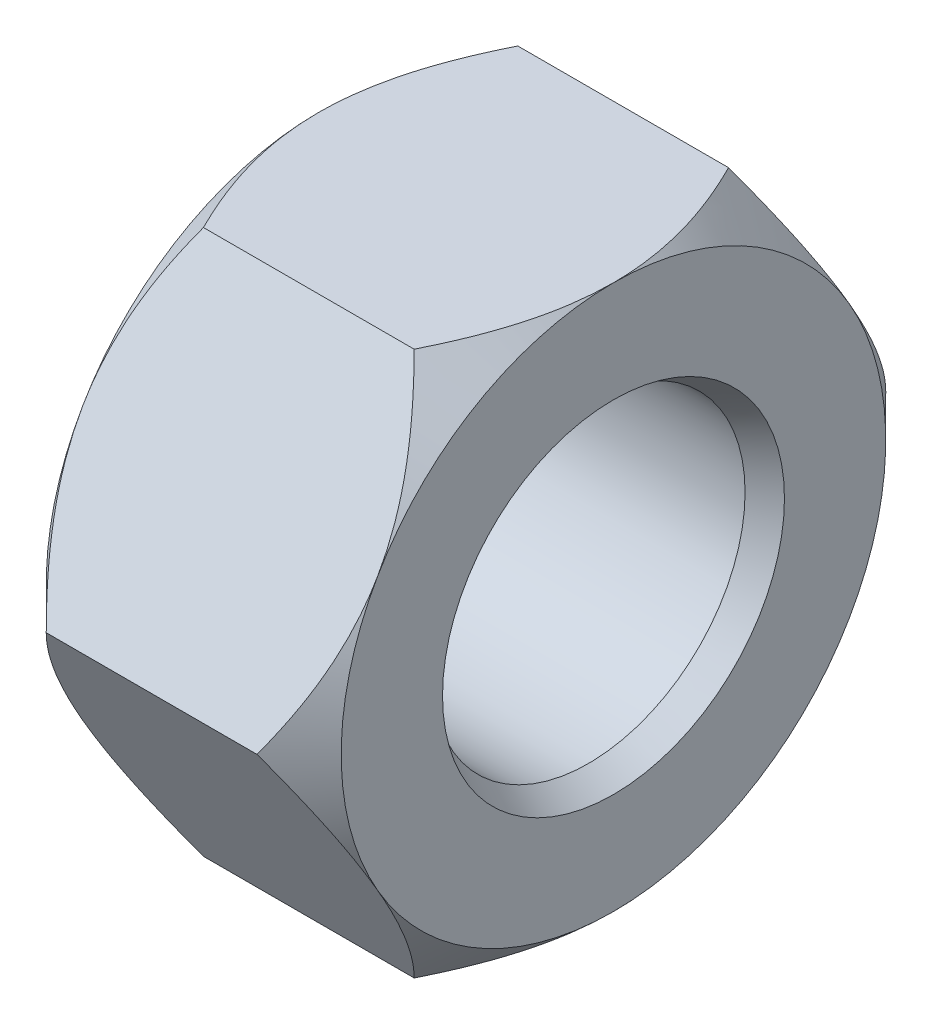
from build123d import *
from OCP.BRepFilletAPI import BRepFilletAPI_MakeChamfer

# Parameters (mm, degrees)
ESQUISSE2_OUTSIDE_W    = 47.236
ESQUISSE2_OUTSIDE_H    = 47.236
PROFIL_HEXAGONAL_DEPTH = 28.955321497
CHANFREIN1_SIZE        = 1.1
CHANFREIN1_SIZE2       = 0.635085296


with BuildPart() as part:
    # Esquisse1 → Volume (revolve)
    with BuildSketch(Plane.XY, mode=Mode.PRIVATE) as volume_sk:
        Polygon((0, 12), (0, 6.9), (13, 6.9), (13, 12), (7.5, 17.5), (5.5, 17.5), align=None)
    revolve(volume_sk.sketch.rotate(Axis((-26.703631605, 0, 0), (1, 0, 0)), 90), axis=Axis((-26.703631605, 0, 0), (1, 0, 0)))

    # Esquisse2 outside → Profil hexagonal (cut, through all)
    with BuildSketch(Plane.ZY):
        Rectangle(ESQUISSE2_OUTSIDE_W, ESQUISSE2_OUTSIDE_H)
        Polygon((6.92820323, -12), (13.856406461, 0), (6.92820323, 12), (-6.92820323, 12), (-13.856406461, 0), (-6.92820323, -12), align=None, mode=Mode.SUBTRACT)
    extrude(amount=-PROFIL_HEXAGONAL_DEPTH, mode=Mode.SUBTRACT)

    # Chanfrein1: one chamfer whose edges measure the first distance from different faces: ONE call of the kernel's chamfer builder (chamfer() names one face for all edges)
    chanfrein1_edges_1 = [part.edges().sort_by_distance(p)[0] for p in [
        (0, 0, -6.9),
    ]]
    chanfrein1_side_1 = [part.faces().sort_by_distance(p)[0] for p in [
        (0, -4.5e-08, 11.660588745),
    ]]
    chanfrein1_edges_2 = [part.edges().sort_by_distance(p)[0] for p in [
        (13, 0, -6.9),
    ]]
    chanfrein1_side_2 = [part.faces().sort_by_distance(p)[0] for p in [
        (6.5, 0, -6.9),
    ]]
    chanfrein1 = BRepFilletAPI_MakeChamfer(part.part.solid().wrapped)
    for e in chanfrein1_edges_1:
        chanfrein1.Add(CHANFREIN1_SIZE, CHANFREIN1_SIZE2, e.wrapped, chanfrein1_side_1[0].wrapped)  # the first distance lies on this face
    for e in chanfrein1_edges_2:
        chanfrein1.Add(CHANFREIN1_SIZE, CHANFREIN1_SIZE2, e.wrapped, chanfrein1_side_2[0].wrapped)  # the first distance lies on this face
    add(Compound.cast(chanfrein1.Shape()), mode=Mode.REPLACE)


solid = part.part
